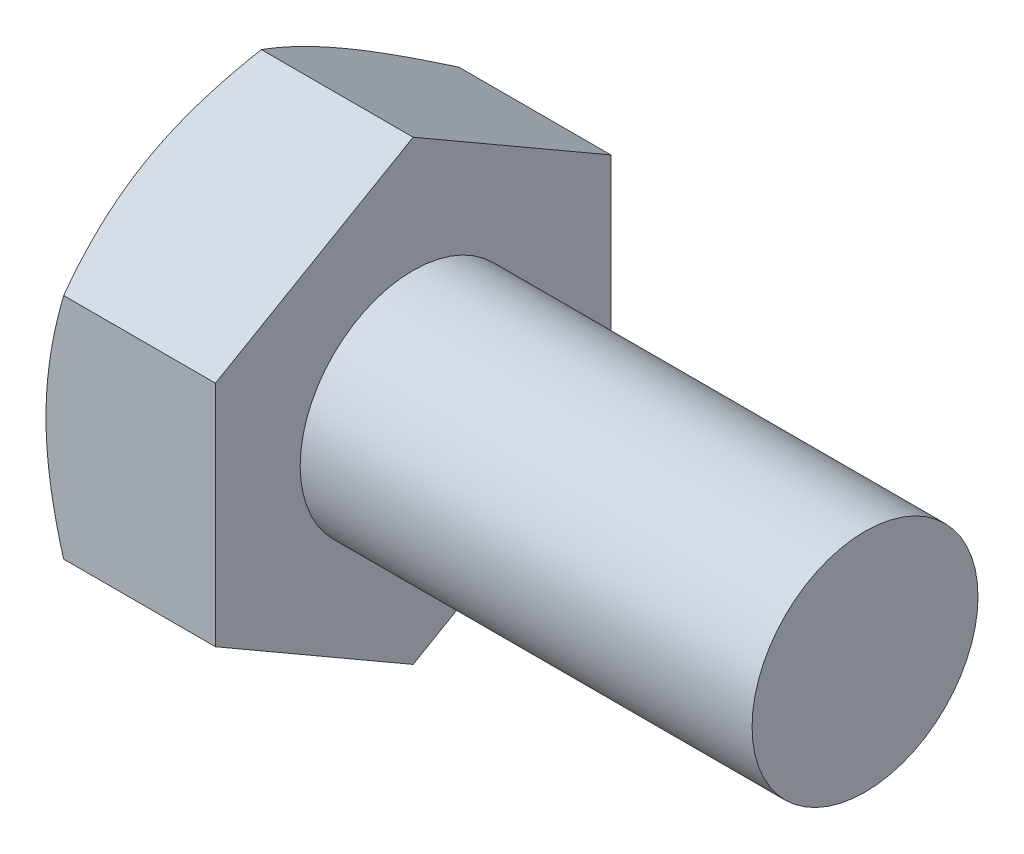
from build123d import *

# Parameters (mm, degrees)
SKETCH2_R     = 4.081986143
HEX_DIE_DEPTH = 3


with BuildPart() as part:
    # BodySke → Base-Revolve (revolve)
    with BuildSketch(Plane.XY, mode=Mode.PRIVATE) as base_revolve_sk:
        Polygon((3, 2), (3, 4.041570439), (0.312675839, 4.041570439), (0, 3.5), (0, 0), (11, 0), (11, 2), align=None)
    revolve(base_revolve_sk.sketch.rotate(Axis((-25.4, 0, 0), (1, 0, 0)), 90), axis=Axis((-25.4, 0, 0), (1, 0, 0)))

    # Sketch2 → Hex-Die (cut)
    with BuildSketch(Plane(origin=(0, 0, 0), x_dir=(0, 0, -1), z_dir=(1, 0, 0))):
        Circle(SKETCH2_R)
        Polygon((-3.5, 2.020725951), (0, 4.041451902), (3.5, 2.020725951), (3.5, -2.020725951), (0, -4.041451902), (-3.5, -2.020725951), align=None, mode=Mode.SUBTRACT)
    extrude(amount=HEX_DIE_DEPTH, mode=Mode.SUBTRACT)


solid = part.part
